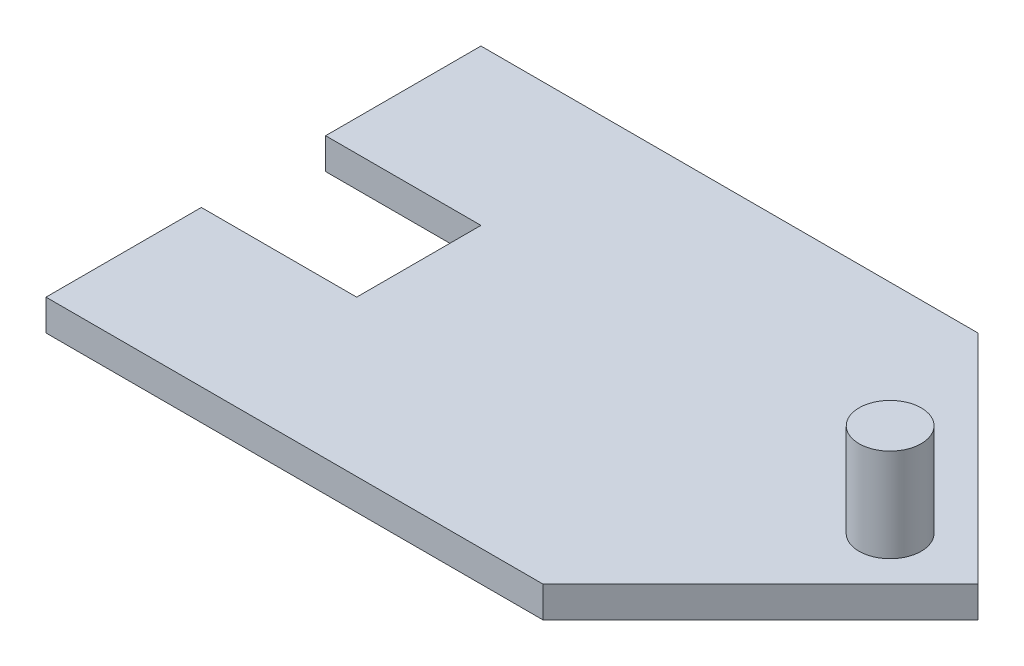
from build123d import *

# Parameters (mm, degrees)
EXTRUDE1_DEPTH = 5
SKETCH2_R      = 5
EXTRUDE2_DEPTH = 15


with BuildPart() as part:
    # Sketch1 → Extrude1 (new body)
    with BuildSketch(Plane(origin=(0, 0, 0), x_dir=(1, 0, 0), z_dir=(0, 1, 0))):
        Polygon((0, 0), (80, 0), (115, 35), (80, 70), (0, 70), (0, 45), (25, 45), (25, 25), (0, 25), align=None)
    extrude(amount=EXTRUDE1_DEPTH)

    # Sketch2 → Extrude2 (add)
    with BuildSketch(Plane(origin=(0, 5, 0), x_dir=(-1, 0, 0), z_dir=(0, 1, 0))):
        with Locations(Location((-100.857864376, -35, 0), (0, 0, 90))):
            Circle(SKETCH2_R)
    extrude(amount=EXTRUDE2_DEPTH)


solid = part.part
